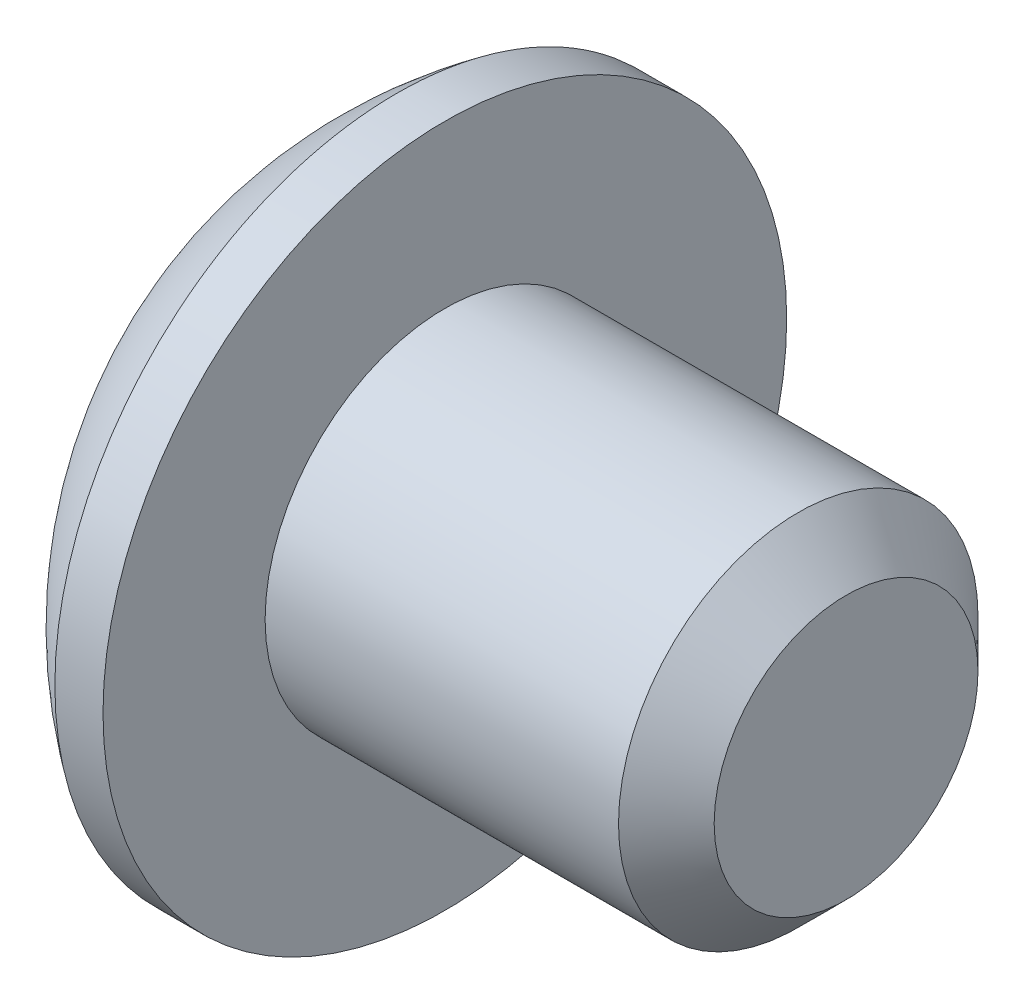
ISO-10303-21;
HEADER;
FILE_DESCRIPTION(('STEP AP214'),'2;1');
FILE_NAME('part.step','',(''),(''),'','','');
FILE_SCHEMA(('AUTOMOTIVE_DESIGN { 1 0 10303 214 1 1 1 1 }'));
ENDSEC;
DATA;
#1=APPLICATION_CONTEXT('core data for automotive mechanical design processes');
#2=APPLICATION_PROTOCOL_DEFINITION('international standard','automotive_design',2000,#1);
#3=PRODUCT_CONTEXT('',#1,'mechanical');
#4=PRODUCT('Part','Part','',(#3));
#5=PRODUCT_RELATED_PRODUCT_CATEGORY('part','',(#4));
#6=PRODUCT_DEFINITION_FORMATION('','',#4);
#7=PRODUCT_DEFINITION_CONTEXT('part definition',#1,'design');
#8=PRODUCT_DEFINITION('design','',#6,#7);
#9=PRODUCT_DEFINITION_SHAPE('','',#8);
#10=(LENGTH_UNIT() NAMED_UNIT(*) SI_UNIT(.MILLI.,.METRE.));
#11=(NAMED_UNIT(*) PLANE_ANGLE_UNIT() SI_UNIT($,.RADIAN.));
#12=(NAMED_UNIT(*) SI_UNIT($,.STERADIAN.) SOLID_ANGLE_UNIT());
#13=UNCERTAINTY_MEASURE_WITH_UNIT(LENGTH_MEASURE(1.E-05),#10,'distance_accuracy_value','');
#14=(GEOMETRIC_REPRESENTATION_CONTEXT(3) GLOBAL_UNCERTAINTY_ASSIGNED_CONTEXT((#13)) GLOBAL_UNIT_ASSIGNED_CONTEXT((#10,
#11,#12)) REPRESENTATION_CONTEXT('',''));
#15=CARTESIAN_POINT('',(0.,0.,0.));
#16=DIRECTION('',(0.,0.,1.));
#17=DIRECTION('',(1.,0.,0.));
#18=AXIS2_PLACEMENT_3D('',#15,#16,#17);
#19=CARTESIAN_POINT('',(0.889000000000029,0.,0.));
#20=DIRECTION('',(-1.,0.,0.));
#21=DIRECTION('',(0.,0.,1.));
#22=AXIS2_PLACEMENT_3D('',#19,#20,#21);
#23=CONICAL_SURFACE('',#22,0.787399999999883,1.04719755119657);
#24=CARTESIAN_POINT('',(1.3436056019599,0.,0.));
#25=VERTEX_POINT('',#24);
#26=VERTEX_LOOP('',#25);
#27=FACE_BOUND('',#26,.T.);
#28=CARTESIAN_POINT('',(0.888999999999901,0.,0.));
#29=DIRECTION('',(-1.,0.,0.));
#30=DIRECTION('',(0.,0.,1.));
#31=AXIS2_PLACEMENT_3D('',#28,#29,#30);
#32=CIRCLE('',#31,0.787400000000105);
#33=CARTESIAN_POINT('',(0.88899999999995,-0.681908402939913,0.393700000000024));
#34=VERTEX_POINT('',#33);
#35=CARTESIAN_POINT('',(0.888999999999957,0.,0.787400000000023));
#36=VERTEX_POINT('',#35);
#37=EDGE_CURVE('E20',#34,#36,#32,.T.);
#38=ORIENTED_EDGE('',*,*,#37,.T.);
#39=CARTESIAN_POINT('',(0.888999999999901,0.,0.));
#40=DIRECTION('',(-1.,0.,0.));
#41=DIRECTION('',(0.,0.,1.));
#42=AXIS2_PLACEMENT_3D('',#39,#40,#41);
#43=CIRCLE('',#42,0.787400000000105);
#44=CARTESIAN_POINT('',(0.88899999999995,0.681908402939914,0.393700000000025));
#45=VERTEX_POINT('',#44);
#46=EDGE_CURVE('E150',#36,#45,#43,.T.);
#47=ORIENTED_EDGE('',*,*,#46,.T.);
#48=CARTESIAN_POINT('',(0.888999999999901,0.,0.));
#49=DIRECTION('',(-1.,0.,0.));
#50=DIRECTION('',(0.,0.,1.));
#51=AXIS2_PLACEMENT_3D('',#48,#49,#50);
#52=CIRCLE('',#51,0.787400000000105);
#53=CARTESIAN_POINT('',(0.88899999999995,0.681908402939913,-0.393700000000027));
#54=VERTEX_POINT('',#53);
#55=EDGE_CURVE('E438',#45,#54,#52,.T.);
#56=ORIENTED_EDGE('',*,*,#55,.T.);
#57=CARTESIAN_POINT('',(0.888999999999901,0.,0.));
#58=DIRECTION('',(-1.,0.,0.));
#59=DIRECTION('',(0.,0.,1.));
#60=AXIS2_PLACEMENT_3D('',#57,#58,#59);
#61=CIRCLE('',#60,0.787400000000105);
#62=CARTESIAN_POINT('',(0.888999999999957,0.,-0.787400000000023));
#63=VERTEX_POINT('',#62);
#64=EDGE_CURVE('E439',#54,#63,#61,.T.);
#65=ORIENTED_EDGE('',*,*,#64,.T.);
#66=CARTESIAN_POINT('',(0.888999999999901,0.,0.));
#67=DIRECTION('',(-1.,0.,0.));
#68=DIRECTION('',(0.,0.,1.));
#69=AXIS2_PLACEMENT_3D('',#66,#67,#68);
#70=CIRCLE('',#69,0.787400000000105);
#71=CARTESIAN_POINT('',(0.88899999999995,-0.681908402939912,-0.393700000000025));
#72=VERTEX_POINT('',#71);
#73=EDGE_CURVE('E110',#63,#72,#70,.T.);
#74=ORIENTED_EDGE('',*,*,#73,.T.);
#75=CARTESIAN_POINT('',(0.888999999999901,0.,0.));
#76=DIRECTION('',(-1.,0.,0.));
#77=DIRECTION('',(0.,0.,1.));
#78=AXIS2_PLACEMENT_3D('',#75,#76,#77);
#79=CIRCLE('',#78,0.787400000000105);
#80=EDGE_CURVE('E96',#72,#34,#79,.T.);
#81=ORIENTED_EDGE('',*,*,#80,.T.);
#82=EDGE_LOOP('',(#38,#47,#56,#65,#74,#81));
#83=FACE_BOUND('',#82,.T.);
#84=ADVANCED_FACE('F17',(#27,#83),#23,.F.);
#85=CARTESIAN_POINT('',(0.889,-1.36381680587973,-0.7874));
#86=DIRECTION('',(1.,0.,0.));
#87=DIRECTION('',(0.,0.,-1.));
#88=AXIS2_PLACEMENT_3D('',#85,#86,#87);
#89=PLANE('',#88);
#90=DIRECTION('',(0.,0.499999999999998,0.86602540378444));
#91=VECTOR('',#90,1.);
#92=CARTESIAN_POINT('',(0.889,-0.90921120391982,0.));
#93=LINE('',#92,#91);
#94=CARTESIAN_POINT('',(0.889,-0.454605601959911,0.787400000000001));
#95=VERTEX_POINT('',#94);
#96=EDGE_CURVE('E91',#95,#34,#93,.F.);
#97=ORIENTED_EDGE('',*,*,#96,.F.);
#98=DIRECTION('',(0.,1.,0.));
#99=VECTOR('',#98,1.);
#100=CARTESIAN_POINT('',(0.889,-0.454605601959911,0.787400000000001));
#101=LINE('',#100,#99);
#102=EDGE_CURVE('E92',#36,#95,#101,.F.);
#103=ORIENTED_EDGE('',*,*,#102,.F.);
#104=ORIENTED_EDGE('',*,*,#37,.F.);
#105=EDGE_LOOP('',(#97,#103,#104));
#106=FACE_BOUND('',#105,.T.);
#107=ADVANCED_FACE('F90',(#106),#89,.F.);
#108=CARTESIAN_POINT('',(0.889,-1.36381680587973,-0.7874));
#109=DIRECTION('',(1.,0.,0.));
#110=DIRECTION('',(0.,0.,-1.));
#111=AXIS2_PLACEMENT_3D('',#108,#109,#110);
#112=PLANE('',#111);
#113=DIRECTION('',(0.,-0.499999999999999,0.866025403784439));
#114=VECTOR('',#113,1.);
#115=CARTESIAN_POINT('',(0.889,-0.454605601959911,-0.7874));
#116=LINE('',#115,#114);
#117=CARTESIAN_POINT('',(0.889,-0.90921120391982,0.));
#118=VERTEX_POINT('',#117);
#119=EDGE_CURVE('E116',#118,#72,#116,.F.);
#120=ORIENTED_EDGE('',*,*,#119,.F.);
#121=DIRECTION('',(0.,0.499999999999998,0.86602540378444));
#122=VECTOR('',#121,1.);
#123=CARTESIAN_POINT('',(0.889,-0.90921120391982,0.));
#124=LINE('',#123,#122);
#125=EDGE_CURVE('E103',#34,#118,#124,.F.);
#126=ORIENTED_EDGE('',*,*,#125,.F.);
#127=ORIENTED_EDGE('',*,*,#80,.F.);
#128=EDGE_LOOP('',(#120,#126,#127));
#129=FACE_BOUND('',#128,.T.);
#130=ADVANCED_FACE('F115',(#129),#112,.F.);
#131=CARTESIAN_POINT('',(0.889,-1.36381680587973,-0.7874));
#132=DIRECTION('',(1.,0.,0.));
#133=DIRECTION('',(0.,0.,-1.));
#134=AXIS2_PLACEMENT_3D('',#131,#132,#133);
#135=PLANE('',#134);
#136=DIRECTION('',(0.,-1.,0.));
#137=VECTOR('',#136,1.);
#138=CARTESIAN_POINT('',(0.889,0.454605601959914,-0.787400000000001));
#139=LINE('',#138,#137);
#140=CARTESIAN_POINT('',(0.889,-0.454605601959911,-0.7874));
#141=VERTEX_POINT('',#140);
#142=EDGE_CURVE('E410',#141,#63,#139,.F.);
#143=ORIENTED_EDGE('',*,*,#142,.F.);
#144=DIRECTION('',(0.,-0.499999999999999,0.866025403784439));
#145=VECTOR('',#144,1.);
#146=CARTESIAN_POINT('',(0.889,-0.454605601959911,-0.7874));
#147=LINE('',#146,#145);
#148=EDGE_CURVE('E422',#72,#141,#147,.F.);
#149=ORIENTED_EDGE('',*,*,#148,.F.);
#150=ORIENTED_EDGE('',*,*,#73,.F.);
#151=EDGE_LOOP('',(#143,#149,#150));
#152=FACE_BOUND('',#151,.T.);
#153=ADVANCED_FACE('F195',(#152),#135,.F.);
#154=CARTESIAN_POINT('',(0.889,-1.36381680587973,-0.7874));
#155=DIRECTION('',(1.,0.,0.));
#156=DIRECTION('',(0.,0.,-1.));
#157=AXIS2_PLACEMENT_3D('',#154,#155,#156);
#158=PLANE('',#157);
#159=DIRECTION('',(0.,-0.5,-0.866025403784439));
#160=VECTOR('',#159,1.);
#161=CARTESIAN_POINT('',(0.889,0.909211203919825,0.));
#162=LINE('',#161,#160);
#163=CARTESIAN_POINT('',(0.889,0.454605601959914,-0.787400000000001));
#164=VERTEX_POINT('',#163);
#165=EDGE_CURVE('E396',#164,#54,#162,.F.);
#166=ORIENTED_EDGE('',*,*,#165,.F.);
#167=DIRECTION('',(0.,-1.,0.));
#168=VECTOR('',#167,1.);
#169=CARTESIAN_POINT('',(0.889,0.454605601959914,-0.787400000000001));
#170=LINE('',#169,#168);
#171=EDGE_CURVE('E408',#63,#164,#170,.F.);
#172=ORIENTED_EDGE('',*,*,#171,.F.);
#173=ORIENTED_EDGE('',*,*,#64,.F.);
#174=EDGE_LOOP('',(#166,#172,#173));
#175=FACE_BOUND('',#174,.T.);
#176=ADVANCED_FACE('F191',(#175),#158,.F.);
#177=CARTESIAN_POINT('',(0.889,-1.36381680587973,-0.7874));
#178=DIRECTION('',(1.,0.,0.));
#179=DIRECTION('',(0.,0.,-1.));
#180=AXIS2_PLACEMENT_3D('',#177,#178,#179);
#181=PLANE('',#180);
#182=DIRECTION('',(0.,0.499999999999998,-0.86602540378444));
#183=VECTOR('',#182,1.);
#184=CARTESIAN_POINT('',(0.889,0.454605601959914,0.787400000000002));
#185=LINE('',#184,#183);
#186=CARTESIAN_POINT('',(0.889,0.909211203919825,0.));
#187=VERTEX_POINT('',#186);
#188=EDGE_CURVE('E372',#187,#45,#185,.F.);
#189=ORIENTED_EDGE('',*,*,#188,.F.);
#190=DIRECTION('',(0.,-0.5,-0.866025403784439));
#191=VECTOR('',#190,1.);
#192=CARTESIAN_POINT('',(0.889,0.909211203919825,0.));
#193=LINE('',#192,#191);
#194=EDGE_CURVE('E394',#54,#187,#193,.F.);
#195=ORIENTED_EDGE('',*,*,#194,.F.);
#196=ORIENTED_EDGE('',*,*,#55,.F.);
#197=EDGE_LOOP('',(#189,#195,#196));
#198=FACE_BOUND('',#197,.T.);
#199=ADVANCED_FACE('F187',(#198),#181,.F.);
#200=CARTESIAN_POINT('',(0.889,-1.36381680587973,-0.7874));
#201=DIRECTION('',(1.,0.,0.));
#202=DIRECTION('',(0.,0.,-1.));
#203=AXIS2_PLACEMENT_3D('',#200,#201,#202);
#204=PLANE('',#203);
#205=DIRECTION('',(0.,1.,0.));
#206=VECTOR('',#205,1.);
#207=CARTESIAN_POINT('',(0.889,-0.454605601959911,0.787400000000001));
#208=LINE('',#207,#206);
#209=CARTESIAN_POINT('',(0.889,0.454605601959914,0.787400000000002));
#210=VERTEX_POINT('',#209);
#211=EDGE_CURVE('E130',#210,#36,#208,.F.);
#212=ORIENTED_EDGE('',*,*,#211,.F.);
#213=DIRECTION('',(0.,0.499999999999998,-0.86602540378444));
#214=VECTOR('',#213,1.);
#215=CARTESIAN_POINT('',(0.889,0.454605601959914,0.787400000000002));
#216=LINE('',#215,#214);
#217=EDGE_CURVE('E375',#45,#210,#216,.F.);
#218=ORIENTED_EDGE('',*,*,#217,.F.);
#219=ORIENTED_EDGE('',*,*,#46,.F.);
#220=EDGE_LOOP('',(#212,#218,#219));
#221=FACE_BOUND('',#220,.T.);
#222=ADVANCED_FACE('F183',(#221),#204,.F.);
#223=CARTESIAN_POINT('',(0.889,-0.454605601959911,0.787400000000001));
#224=DIRECTION('',(0.,0.,-1.));
#225=DIRECTION('',(0.,1.,0.));
#226=AXIS2_PLACEMENT_3D('',#223,#224,#225);
#227=PLANE('',#226);
#228=DIRECTION('',(0.,1.,0.));
#229=VECTOR('',#228,1.);
#230=CARTESIAN_POINT('',(0.,0.,0.787400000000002));
#231=LINE('',#230,#229);
#232=CARTESIAN_POINT('',(0.,0.454605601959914,0.787400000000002));
#233=VERTEX_POINT('',#232);
#234=CARTESIAN_POINT('',(0.,-0.454605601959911,0.787400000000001));
#235=VERTEX_POINT('',#234);
#236=EDGE_CURVE('E369',#233,#235,#231,.F.);
#237=ORIENTED_EDGE('',*,*,#236,.F.);
#238=DIRECTION('',(1.,0.,0.));
#239=VECTOR('',#238,1.);
#240=CARTESIAN_POINT('',(0.889,0.454605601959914,0.787400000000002));
#241=LINE('',#240,#239);
#242=EDGE_CURVE('E380',#210,#233,#241,.F.);
#243=ORIENTED_EDGE('',*,*,#242,.F.);
#244=ORIENTED_EDGE('',*,*,#211,.T.);
#245=ORIENTED_EDGE('',*,*,#102,.T.);
#246=DIRECTION('',(1.,0.,0.));
#247=VECTOR('',#246,1.);
#248=CARTESIAN_POINT('',(0.889,-0.454605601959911,0.787400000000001));
#249=LINE('',#248,#247);
#250=EDGE_CURVE('E106',#235,#95,#249,.T.);
#251=ORIENTED_EDGE('',*,*,#250,.F.);
#252=EDGE_LOOP('',(#237,#243,#244,#245,#251));
#253=FACE_BOUND('',#252,.T.);
#254=ADVANCED_FACE('F180',(#253),#227,.T.);
#255=CARTESIAN_POINT('',(0.889,-0.90921120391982,0.));
#256=DIRECTION('',(0.,0.86602540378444,-0.499999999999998));
#257=DIRECTION('',(0.,0.499999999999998,0.86602540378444));
#258=AXIS2_PLACEMENT_3D('',#255,#256,#257);
#259=PLANE('',#258);
#260=DIRECTION('',(0.,-0.499999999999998,-0.86602540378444));
#261=VECTOR('',#260,1.);
#262=CARTESIAN_POINT('',(0.,-0.454605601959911,0.787400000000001));
#263=LINE('',#262,#261);
#264=CARTESIAN_POINT('',(0.,-0.90921120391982,0.));
#265=VERTEX_POINT('',#264);
#266=EDGE_CURVE('E367',#235,#265,#263,.T.);
#267=ORIENTED_EDGE('',*,*,#266,.F.);
#268=ORIENTED_EDGE('',*,*,#250,.T.);
#269=ORIENTED_EDGE('',*,*,#96,.T.);
#270=ORIENTED_EDGE('',*,*,#125,.T.);
#271=DIRECTION('',(1.,0.,0.));
#272=VECTOR('',#271,1.);
#273=CARTESIAN_POINT('',(0.889,-0.90921120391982,0.));
#274=LINE('',#273,#272);
#275=EDGE_CURVE('E415',#265,#118,#274,.T.);
#276=ORIENTED_EDGE('',*,*,#275,.F.);
#277=EDGE_LOOP('',(#267,#268,#269,#270,#276));
#278=FACE_BOUND('',#277,.T.);
#279=ADVANCED_FACE('F100',(#278),#259,.T.);
#280=CARTESIAN_POINT('',(0.889,-0.454605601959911,-0.7874));
#281=DIRECTION('',(0.,0.866025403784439,0.499999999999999));
#282=DIRECTION('',(0.,-0.499999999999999,0.866025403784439));
#283=AXIS2_PLACEMENT_3D('',#280,#281,#282);
#284=PLANE('',#283);
#285=DIRECTION('',(0.,0.499999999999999,-0.866025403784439));
#286=VECTOR('',#285,1.);
#287=CARTESIAN_POINT('',(0.,-0.90921120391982,0.));
#288=LINE('',#287,#286);
#289=CARTESIAN_POINT('',(0.,-0.454605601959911,-0.7874));
#290=VERTEX_POINT('',#289);
#291=EDGE_CURVE('E365',#265,#290,#288,.T.);
#292=ORIENTED_EDGE('',*,*,#291,.F.);
#293=ORIENTED_EDGE('',*,*,#275,.T.);
#294=ORIENTED_EDGE('',*,*,#119,.T.);
#295=ORIENTED_EDGE('',*,*,#148,.T.);
#296=DIRECTION('',(1.,0.,0.));
#297=VECTOR('',#296,1.);
#298=CARTESIAN_POINT('',(0.889,-0.454605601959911,-0.7874));
#299=LINE('',#298,#297);
#300=EDGE_CURVE('E401',#290,#141,#299,.T.);
#301=ORIENTED_EDGE('',*,*,#300,.F.);
#302=EDGE_LOOP('',(#292,#293,#294,#295,#301));
#303=FACE_BOUND('',#302,.T.);
#304=ADVANCED_FACE('F173',(#303),#284,.T.);
#305=CARTESIAN_POINT('',(0.889,0.454605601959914,-0.787400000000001));
#306=DIRECTION('',(0.,0.,1.));
#307=DIRECTION('',(0.,-1.,0.));
#308=AXIS2_PLACEMENT_3D('',#305,#306,#307);
#309=PLANE('',#308);
#310=DIRECTION('',(0.,1.,0.));
#311=VECTOR('',#310,1.);
#312=CARTESIAN_POINT('',(0.,0.,-0.7874));
#313=LINE('',#312,#311);
#314=CARTESIAN_POINT('',(0.,0.454605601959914,-0.787400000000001));
#315=VERTEX_POINT('',#314);
#316=EDGE_CURVE('E363',#290,#315,#313,.T.);
#317=ORIENTED_EDGE('',*,*,#316,.F.);
#318=ORIENTED_EDGE('',*,*,#300,.T.);
#319=ORIENTED_EDGE('',*,*,#142,.T.);
#320=ORIENTED_EDGE('',*,*,#171,.T.);
#321=DIRECTION('',(1.,0.,0.));
#322=VECTOR('',#321,1.);
#323=CARTESIAN_POINT('',(0.889,0.454605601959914,-0.787400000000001));
#324=LINE('',#323,#322);
#325=EDGE_CURVE('E376',#315,#164,#324,.T.);
#326=ORIENTED_EDGE('',*,*,#325,.F.);
#327=EDGE_LOOP('',(#317,#318,#319,#320,#326));
#328=FACE_BOUND('',#327,.T.);
#329=ADVANCED_FACE('F169',(#328),#309,.T.);
#330=CARTESIAN_POINT('',(0.889,0.909211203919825,0.));
#331=DIRECTION('',(0.,-0.866025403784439,0.5));
#332=DIRECTION('',(0.,-0.5,-0.866025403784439));
#333=AXIS2_PLACEMENT_3D('',#330,#331,#332);
#334=PLANE('',#333);
#335=DIRECTION('',(0.,0.5,0.866025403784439));
#336=VECTOR('',#335,1.);
#337=CARTESIAN_POINT('',(0.,0.454605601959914,-0.787400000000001));
#338=LINE('',#337,#336);
#339=CARTESIAN_POINT('',(0.,0.909211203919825,0.));
#340=VERTEX_POINT('',#339);
#341=EDGE_CURVE('E35',#315,#340,#338,.T.);
#342=ORIENTED_EDGE('',*,*,#341,.F.);
#343=ORIENTED_EDGE('',*,*,#325,.T.);
#344=ORIENTED_EDGE('',*,*,#165,.T.);
#345=ORIENTED_EDGE('',*,*,#194,.T.);
#346=DIRECTION('',(1.,0.,0.));
#347=VECTOR('',#346,1.);
#348=CARTESIAN_POINT('',(0.889,0.909211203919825,0.));
#349=LINE('',#348,#347);
#350=EDGE_CURVE('E371',#340,#187,#349,.T.);
#351=ORIENTED_EDGE('',*,*,#350,.F.);
#352=EDGE_LOOP('',(#342,#343,#344,#345,#351));
#353=FACE_BOUND('',#352,.T.);
#354=ADVANCED_FACE('F165',(#353),#334,.T.);
#355=CARTESIAN_POINT('',(0.889,0.454605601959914,0.787400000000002));
#356=DIRECTION('',(0.,-0.86602540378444,-0.499999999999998));
#357=DIRECTION('',(0.,0.499999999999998,-0.86602540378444));
#358=AXIS2_PLACEMENT_3D('',#355,#356,#357);
#359=PLANE('',#358);
#360=DIRECTION('',(0.,-0.499999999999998,0.86602540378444));
#361=VECTOR('',#360,1.);
#362=CARTESIAN_POINT('',(0.,0.909211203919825,0.));
#363=LINE('',#362,#361);
#364=EDGE_CURVE('E149',#340,#233,#363,.T.);
#365=ORIENTED_EDGE('',*,*,#364,.F.);
#366=ORIENTED_EDGE('',*,*,#350,.T.);
#367=ORIENTED_EDGE('',*,*,#188,.T.);
#368=ORIENTED_EDGE('',*,*,#217,.T.);
#369=ORIENTED_EDGE('',*,*,#242,.T.);
#370=EDGE_LOOP('',(#365,#366,#367,#368,#369));
#371=FACE_BOUND('',#370,.T.);
#372=ADVANCED_FACE('F162',(#371),#359,.T.);
#373=CARTESIAN_POINT('',(0.,0.,0.));
#374=DIRECTION('',(-1.,0.,0.));
#375=DIRECTION('',(0.,0.,1.));
#376=AXIS2_PLACEMENT_3D('',#373,#374,#375);
#377=PLANE('',#376);
#378=ORIENTED_EDGE('',*,*,#341,.T.);
#379=ORIENTED_EDGE('',*,*,#364,.T.);
#380=ORIENTED_EDGE('',*,*,#236,.T.);
#381=ORIENTED_EDGE('',*,*,#266,.T.);
#382=ORIENTED_EDGE('',*,*,#291,.T.);
#383=ORIENTED_EDGE('',*,*,#316,.T.);
#384=EDGE_LOOP('',(#378,#379,#380,#381,#382,#383));
#385=FACE_BOUND('',#384,.T.);
#386=CARTESIAN_POINT('',(0.,1.35255,0.));
#387=CARTESIAN_POINT('',(1.27342185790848E-13,1.35254570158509,0.0759168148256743));
#388=CARTESIAN_POINT('',(1.04021703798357E-13,1.34612315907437,0.151968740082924));
#389=CARTESIAN_POINT('',(0.,1.32701210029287,0.264362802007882));
#390=CARTESIAN_POINT('',(-1.23599147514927E-13,1.31904554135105,0.301594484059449));
#391=CARTESIAN_POINT('',(1.24567372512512E-13,1.29999852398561,0.375291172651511));
#392=CARTESIAN_POINT('',(4.45155689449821E-13,1.28891553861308,0.411755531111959));
#393=CARTESIAN_POINT('',(7.32931801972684E-13,1.25114440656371,0.519422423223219));
#394=CARTESIAN_POINT('',(0.,1.21990306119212,0.589079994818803));
#395=CARTESIAN_POINT('',(0.,1.14615406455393,0.72215594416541));
#396=CARTESIAN_POINT('',(6.1125725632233E-13,1.10364598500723,0.785574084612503));
#397=CARTESIAN_POINT('',(3.86427878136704E-13,1.03239568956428,0.874644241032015));
#398=CARTESIAN_POINT('',(1.13131576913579E-13,1.00737874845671,0.903341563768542));
#399=CARTESIAN_POINT('',(-1.12155557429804E-13,0.955044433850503,0.958501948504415));
#400=CARTESIAN_POINT('',(0.,0.927729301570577,0.984967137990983));
#401=CARTESIAN_POINT('',(1.30171255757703E-13,0.84255498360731,1.06078283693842));
#402=CARTESIAN_POINT('',(3.28624601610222E-13,0.781451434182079,1.10657274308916));
#403=CARTESIAN_POINT('',(3.04549921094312E-13,0.652457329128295,1.18721706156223));
#404=CARTESIAN_POINT('',(0.,0.584567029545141,1.22207188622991));
#405=CARTESIAN_POINT('',(0.,0.443890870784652,1.2798954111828));
#406=CARTESIAN_POINT('',(0.,0.371105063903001,1.30286423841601));
#407=CARTESIAN_POINT('',(0.,0.22271208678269,1.33625440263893));
#408=CARTESIAN_POINT('',(0.,0.147104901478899,1.34667567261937));
#409=CARTESIAN_POINT('',(0.,-0.00478595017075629,1.35467793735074));
#410=CARTESIAN_POINT('',(0.,-0.0810696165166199,1.35225893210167));
#411=CARTESIAN_POINT('',(0.,-0.23214964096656,1.33464629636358));
#412=CARTESIAN_POINT('',(0.,-0.30694600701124,1.31945273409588));
#413=CARTESIAN_POINT('',(0.,-0.452919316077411,1.27673113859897));
#414=CARTESIAN_POINT('',(0.,-0.524096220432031,1.24920297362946));
#415=CARTESIAN_POINT('',(0.,-0.660850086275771,1.18255940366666));
#416=CARTESIAN_POINT('',(0.,-0.726426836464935,1.14344356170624));
#417=CARTESIAN_POINT('',(0.,-0.819096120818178,1.07699743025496));
#418=CARTESIAN_POINT('',(0.,-0.849040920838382,1.05354894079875));
#419=CARTESIAN_POINT('',(0.,-0.906881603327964,1.00419304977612));
#420=CARTESIAN_POINT('',(0.,-0.934775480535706,0.978283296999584));
#421=CARTESIAN_POINT('',(0.,-1.01499056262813,0.89719298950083));
#422=CARTESIAN_POINT('',(-1.0387216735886E-13,-1.06392710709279,0.838592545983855));
#423=CARTESIAN_POINT('',(1.047355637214E-13,-1.1512510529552,0.714002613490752));
#424=CARTESIAN_POINT('',(3.97909921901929E-13,-1.18963885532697,0.648013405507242));
#425=CARTESIAN_POINT('',(2.39370240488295E-13,-1.23851420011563,0.544911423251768));
#426=CARTESIAN_POINT('',(0.,-1.25336739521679,0.509813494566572));
#427=CARTESIAN_POINT('',(0.,-1.28005279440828,0.438526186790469));
#428=CARTESIAN_POINT('',(-1.03931981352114E-13,-1.29188744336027,0.402337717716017));
#429=CARTESIAN_POINT('',(2.08617780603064E-13,-1.32270273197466,0.292573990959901));
#430=CARTESIAN_POINT('',(9.06098045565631E-13,-1.33708102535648,0.21761794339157));
#431=CARTESIAN_POINT('',(3.40606042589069E-13,-1.34755822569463,0.118513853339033));
#432=CARTESIAN_POINT('',(0.,-1.34942852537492,0.0948530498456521));
#433=CARTESIAN_POINT('',(0.,-1.35192508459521,0.0474659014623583));
#434=CARTESIAN_POINT('',(0.,-1.35255134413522,0.0237395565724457));
#435=CARTESIAN_POINT('',(1.27738578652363E-13,-1.3525457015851,-0.075916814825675));
#436=CARTESIAN_POINT('',(1.03970250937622E-13,-1.34612315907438,-0.151968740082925));
#437=CARTESIAN_POINT('',(0.,-1.32701210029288,-0.264362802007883));
#438=CARTESIAN_POINT('',(-1.23422077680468E-13,-1.31904554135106,-0.30159448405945));
#439=CARTESIAN_POINT('',(1.24390158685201E-13,-1.29999852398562,-0.375291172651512));
#440=CARTESIAN_POINT('',(4.44472381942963E-13,-1.28891553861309,-0.41175553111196));
#441=CARTESIAN_POINT('',(7.31697209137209E-13,-1.25114440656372,-0.519422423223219));
#442=CARTESIAN_POINT('',(0.,-1.21990306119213,-0.589079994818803));
#443=CARTESIAN_POINT('',(0.,-1.14615406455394,-0.72215594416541));
#444=CARTESIAN_POINT('',(6.11301839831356E-13,-1.10364598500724,-0.785574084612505));
#445=CARTESIAN_POINT('',(3.86405557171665E-13,-1.03239568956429,-0.874644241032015));
#446=CARTESIAN_POINT('',(1.13144747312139E-13,-1.00737874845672,-0.903341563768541));
#447=CARTESIAN_POINT('',(-1.12168715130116E-13,-0.955044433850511,-0.958501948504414));
#448=CARTESIAN_POINT('',(0.,-0.927729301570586,-0.984967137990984));
#449=CARTESIAN_POINT('',(1.30320974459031E-13,-0.842554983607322,-1.06078283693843));
#450=CARTESIAN_POINT('',(3.29470124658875E-13,-0.781451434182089,-1.10657274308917));
#451=CARTESIAN_POINT('',(3.05439120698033E-13,-0.652457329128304,-1.18721706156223));
#452=CARTESIAN_POINT('',(0.,-0.58456702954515,-1.22207188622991));
#453=CARTESIAN_POINT('',(0.,-0.443890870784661,-1.2798954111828));
#454=CARTESIAN_POINT('',(0.,-0.37110506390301,-1.30286423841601));
#455=CARTESIAN_POINT('',(0.,-0.222712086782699,-1.33625440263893));
#456=CARTESIAN_POINT('',(0.,-0.147104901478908,-1.34667567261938));
#457=CARTESIAN_POINT('',(0.,0.00478595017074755,-1.35467793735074));
#458=CARTESIAN_POINT('',(0.,0.0810696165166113,-1.35225893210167));
#459=CARTESIAN_POINT('',(0.,0.232149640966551,-1.33464629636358));
#460=CARTESIAN_POINT('',(0.,0.306946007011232,-1.31945273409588));
#461=CARTESIAN_POINT('',(0.,0.452919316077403,-1.27673113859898));
#462=CARTESIAN_POINT('',(0.,0.524096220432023,-1.24920297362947));
#463=CARTESIAN_POINT('',(0.,0.660850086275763,-1.18255940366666));
#464=CARTESIAN_POINT('',(0.,0.726426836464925,-1.14344356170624));
#465=CARTESIAN_POINT('',(0.,0.819096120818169,-1.07699743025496));
#466=CARTESIAN_POINT('',(0.,0.849040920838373,-1.05354894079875));
#467=CARTESIAN_POINT('',(0.,0.906881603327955,-1.00419304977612));
#468=CARTESIAN_POINT('',(0.,0.934775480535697,-0.978283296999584));
#469=CARTESIAN_POINT('',(0.,1.01499056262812,-0.897192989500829));
#470=CARTESIAN_POINT('',(-1.04198107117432E-13,1.06392710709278,-0.838592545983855));
#471=CARTESIAN_POINT('',(1.05061491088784E-13,1.15125105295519,-0.714002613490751));
#472=CARTESIAN_POINT('',(3.99139664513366E-13,1.18963885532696,-0.648013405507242));
#473=CARTESIAN_POINT('',(2.40055978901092E-13,1.23851420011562,-0.544911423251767));
#474=CARTESIAN_POINT('',(0.,1.25336739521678,-0.509813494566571));
#475=CARTESIAN_POINT('',(0.,1.28005279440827,-0.438526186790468));
#476=CARTESIAN_POINT('',(-1.03990656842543E-13,1.29188744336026,-0.402337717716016));
#477=CARTESIAN_POINT('',(2.08734823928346E-13,1.32270273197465,-0.2925739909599));
#478=CARTESIAN_POINT('',(9.06059369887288E-13,1.33708102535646,-0.217617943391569));
#479=CARTESIAN_POINT('',(3.40618136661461E-13,1.34755822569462,-0.118513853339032));
#480=CARTESIAN_POINT('',(0.,1.34942852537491,-0.0948530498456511));
#481=CARTESIAN_POINT('',(0.,1.3519250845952,-0.0474659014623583));
#482=CARTESIAN_POINT('',(0.,1.35255134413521,-0.0237395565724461));
#483=CARTESIAN_POINT('',(0.,1.35255,0.));
#484=B_SPLINE_CURVE_WITH_KNOTS('',3,(#386,#387,#388,#389,#390,#391,#392,#393,#394,#395,#396,
#397,#398,#399,#400,#401,#402,#403,#404,#405,#406,#407,#408,#409,#410,#411,#412,#413,#414,#415,
#416,#417,#418,#419,#420,#421,#422,#423,#424,#425,#426,#427,#428,#429,#430,#431,#432,#433,#434,
#435,#436,#437,#438,#439,#440,#441,#442,#443,#444,#445,#446,#447,#448,#449,#450,#451,#452,#453,
#454,#455,#456,#457,#458,#459,#460,#461,#462,#463,#464,#465,#466,#467,#468,#469,#470,#471,#472,
#473,#474,#475,#476,#477,#478,#479,#480,#481,#482,#483),.UNSPECIFIED.,.T.,.F.,(4,2,2,2,2,2,2,2,
2,2,2,2,2,2,2,2,2,2,2,2,2,2,2,2,2,2,2,2,2,2,2,2,2,2,2,2,2,2,2,2,2,2,2,2,2,2,2,2,4),(0.,
0.227639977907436,0.341759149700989,0.455971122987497,0.683850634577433,0.911738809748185,
1.0258322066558,1.13981560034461,1.36770925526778,1.59559431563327,1.82347694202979,
2.05136078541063,2.27924462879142,2.50712725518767,2.73501231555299,2.96290597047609,
3.07688936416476,3.19098276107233,3.41887093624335,3.64675044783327,3.76096242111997,
3.87508159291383,4.10272157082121,4.17390569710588,4.24508982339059,4.47272980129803,
4.58684897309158,4.70106094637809,4.92894045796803,5.15682863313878,5.27092203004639,
5.3849054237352,5.61279907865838,5.84068413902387,6.06856676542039,6.29645060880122,
6.52433445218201,6.75221707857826,6.98010213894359,7.20799579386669,7.32197918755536,
7.43607258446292,7.66396075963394,7.89184027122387,8.00605224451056,8.12017141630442,
8.3478113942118,8.41899552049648,8.49017964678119),.UNSPECIFIED.);
#485=CARTESIAN_POINT('',(0.,1.35255,0.));
#486=VERTEX_POINT('',#485);
#487=EDGE_CURVE('E142',#486,#486,#484,.T.);
#488=ORIENTED_EDGE('',*,*,#487,.F.);
#489=EDGE_LOOP('',(#488));
#490=FACE_BOUND('',#489,.T.);
#491=ADVANCED_FACE('F157',(#385,#490),#377,.T.);
#492=CARTESIAN_POINT('',(4.6736,0.,0.));
#493=DIRECTION('',(-1.,0.,0.));
#494=DIRECTION('',(0.,0.,1.));
#495=AXIS2_PLACEMENT_3D('',#492,#493,#494);
#496=PLANE('',#495);
#497=CARTESIAN_POINT('',(4.67359999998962,0.,0.));
#498=DIRECTION('',(-1.,0.,0.));
#499=DIRECTION('',(0.,0.,1.));
#500=AXIS2_PLACEMENT_3D('',#497,#498,#499);
#501=CIRCLE('',#500,1.04393999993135);
#502=CARTESIAN_POINT('',(4.67359999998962,0.,1.04393999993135));
#503=VERTEX_POINT('',#502);
#504=EDGE_CURVE('E139',#503,#503,#501,.T.);
#505=ORIENTED_EDGE('',*,*,#504,.F.);
#506=EDGE_LOOP('',(#505));
#507=FACE_BOUND('',#506,.T.);
#508=ADVANCED_FACE('F161',(#507),#496,.F.);
#509=CARTESIAN_POINT('',(3.01413934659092,0.,0.));
#510=DIRECTION('',(0.,1.,0.));
#511=DIRECTION('',(1.,0.,0.));
#512=AXIS2_PLACEMENT_3D('',#509,#510,#511);
#513=SPHERICAL_SURFACE('',#512,3.30369906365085);
#514=CARTESIAN_POINT('',(1.1176,0.,0.));
#515=DIRECTION('',(-1.,0.,0.));
#516=DIRECTION('',(0.,0.,1.));
#517=AXIS2_PLACEMENT_3D('',#514,#515,#516);
#518=CIRCLE('',#517,2.7051);
#519=CARTESIAN_POINT('',(1.1176,0.,2.7051));
#520=VERTEX_POINT('',#519);
#521=EDGE_CURVE('E136',#520,#520,#518,.F.);
#522=ORIENTED_EDGE('',*,*,#521,.F.);
#523=EDGE_LOOP('',(#522));
#524=FACE_BOUND('',#523,.T.);
#525=ORIENTED_EDGE('',*,*,#487,.T.);
#526=EDGE_LOOP('',(#525));
#527=FACE_BOUND('',#526,.T.);
#528=ADVANCED_FACE('F152',(#524,#527),#513,.T.);
#529=CARTESIAN_POINT('',(4.29514000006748,0.,0.));
#530=DIRECTION('',(-1.,0.,0.));
#531=DIRECTION('',(0.,0.,1.));
#532=AXIS2_PLACEMENT_3D('',#529,#530,#531);
#533=CONICAL_SURFACE('',#532,1.4223999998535,0.785398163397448);
#534=CARTESIAN_POINT('',(4.29514,0.,0.));
#535=DIRECTION('',(-1.,0.,0.));
#536=DIRECTION('',(0.,0.,1.));
#537=AXIS2_PLACEMENT_3D('',#534,#535,#536);
#538=CIRCLE('',#537,1.4224);
#539=CARTESIAN_POINT('',(4.29514,0.,1.4224));
#540=VERTEX_POINT('',#539);
#541=EDGE_CURVE('E135',#540,#540,#538,.T.);
#542=ORIENTED_EDGE('',*,*,#541,.F.);
#543=EDGE_LOOP('',(#542));
#544=FACE_BOUND('',#543,.T.);
#545=ORIENTED_EDGE('',*,*,#504,.T.);
#546=EDGE_LOOP('',(#545));
#547=FACE_BOUND('',#546,.T.);
#548=ADVANCED_FACE('F222',(#544,#547),#533,.T.);
#549=CARTESIAN_POINT('',(0.,0.,0.));
#550=DIRECTION('',(-1.,0.,0.));
#551=DIRECTION('',(0.,0.,1.));
#552=AXIS2_PLACEMENT_3D('',#549,#550,#551);
#553=CYLINDRICAL_SURFACE('',#552,2.7051);
#554=ORIENTED_EDGE('',*,*,#521,.T.);
#555=EDGE_LOOP('',(#554));
#556=FACE_BOUND('',#555,.T.);
#557=CARTESIAN_POINT('',(1.4986,0.,0.));
#558=DIRECTION('',(-1.,0.,0.));
#559=DIRECTION('',(0.,0.,1.));
#560=AXIS2_PLACEMENT_3D('',#557,#558,#559);
#561=CIRCLE('',#560,2.7051);
#562=CARTESIAN_POINT('',(1.4986,0.,2.7051));
#563=VERTEX_POINT('',#562);
#564=EDGE_CURVE('E26',#563,#563,#561,.T.);
#565=ORIENTED_EDGE('',*,*,#564,.T.);
#566=EDGE_LOOP('',(#565));
#567=FACE_BOUND('',#566,.T.);
#568=ADVANCED_FACE('F215',(#556,#567),#553,.T.);
#569=CARTESIAN_POINT('',(0.,0.,0.));
#570=DIRECTION('',(-1.,0.,0.));
#571=DIRECTION('',(0.,0.,1.));
#572=AXIS2_PLACEMENT_3D('',#569,#570,#571);
#573=CYLINDRICAL_SURFACE('',#572,1.4224);
#574=CARTESIAN_POINT('',(1.4986,0.,0.));
#575=DIRECTION('',(-1.,0.,0.));
#576=DIRECTION('',(0.,0.,1.));
#577=AXIS2_PLACEMENT_3D('',#574,#575,#576);
#578=CIRCLE('',#577,1.4224);
#579=CARTESIAN_POINT('',(1.4986,0.,1.4224));
#580=VERTEX_POINT('',#579);
#581=EDGE_CURVE('E11',#580,#580,#578,.F.);
#582=ORIENTED_EDGE('',*,*,#581,.T.);
#583=EDGE_LOOP('',(#582));
#584=FACE_BOUND('',#583,.T.);
#585=ORIENTED_EDGE('',*,*,#541,.T.);
#586=EDGE_LOOP('',(#585));
#587=FACE_BOUND('',#586,.T.);
#588=ADVANCED_FACE('F209',(#584,#587),#573,.T.);
#589=CARTESIAN_POINT('',(1.4986,1.42239999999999,0.));
#590=DIRECTION('',(-1.,0.,0.));
#591=DIRECTION('',(0.,0.,1.));
#592=AXIS2_PLACEMENT_3D('',#589,#590,#591);
#593=PLANE('',#592);
#594=ORIENTED_EDGE('',*,*,#581,.F.);
#595=EDGE_LOOP('',(#594));
#596=FACE_BOUND('',#595,.T.);
#597=ORIENTED_EDGE('',*,*,#564,.F.);
#598=EDGE_LOOP('',(#597));
#599=FACE_BOUND('',#598,.T.);
#600=ADVANCED_FACE('F207',(#596,#599),#593,.F.);
#601=CLOSED_SHELL('',(#84,#107,#130,#153,#176,#199,#222,#254,#279,#304,#329,#354,#372,#491,#508,
#528,#548,#568,#588,#600));
#602=MANIFOLD_SOLID_BREP('B1',#601);
#603=ADVANCED_BREP_SHAPE_REPRESENTATION('',(#18,#602),#14);
#604=SHAPE_DEFINITION_REPRESENTATION(#9,#603);
ENDSEC;
END-ISO-10303-21;
